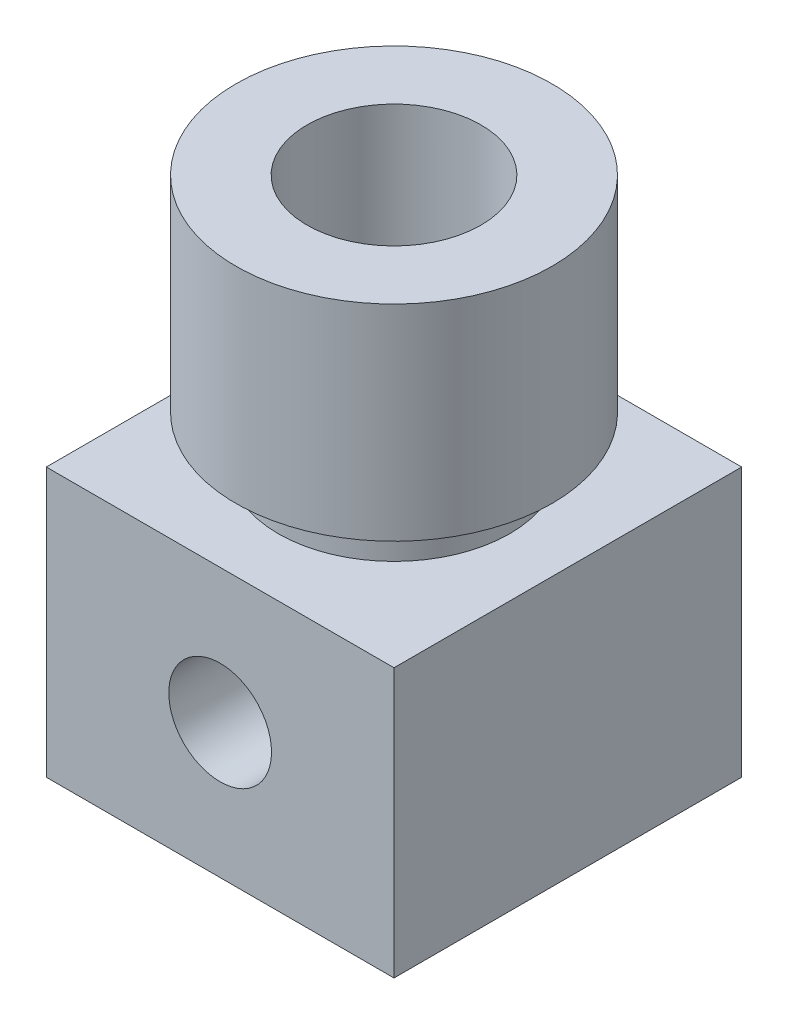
from build123d import *

# Parameters (mm, degrees)
SKETCH1_W           = 22
SKETCH1_H           = 22
SKETCH1_R           = 5.5
BOSS_EXTRUDE1_DEPTH = 17
SKETCH2_R           = 3.25
CUT_EXTRUDE1_DEPTH  = 30.899832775


with BuildPart() as part:
    # Sketch1 → Boss-Extrude1 (new body)
    with BuildSketch(Plane(origin=(0, 0, 0), x_dir=(1, 0, 0), z_dir=(0, 1, 0))):
        Rectangle(SKETCH1_W, SKETCH1_H)
        with Locations(Location((0, 0, 0), (0, 0, 270))):
            Circle(SKETCH1_R, mode=Mode.SUBTRACT)
    extrude(amount=BOSS_EXTRUDE1_DEPTH)

    # Sketch2 → Cut-Extrude1 (cut, through all)
    with BuildSketch(Plane.XY.offset(11)):
        with Locations((0, 8.5)):
            Circle(SKETCH2_R)
    extrude(amount=-CUT_EXTRUDE1_DEPTH, mode=Mode.SUBTRACT)

    # Sketch3 → Revolve1 (revolve)
    with BuildSketch(Plane.XY, mode=Mode.PRIVATE) as revolve1_sk:
        Polygon((-7.318058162, 17), (-7.318058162, 20), (-10, 20), (-10, 33), (-5.5, 33), (-5.5, 17), align=None)
    revolve(revolve1_sk.sketch.rotate(Axis((0, 14.63105937, 0), (0, 1, 0)), 180), axis=Axis((0, 14.63105937, 0), (0, 1, 0)))


solid = part.part
